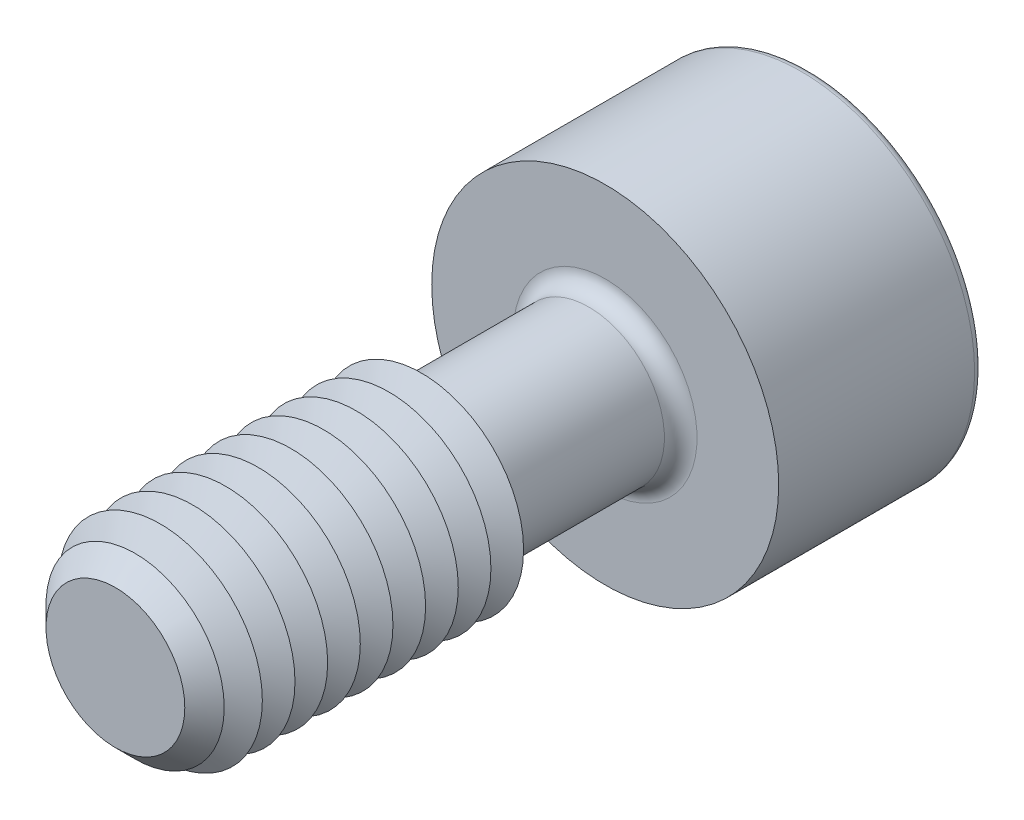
ISO-10303-21;
HEADER;
FILE_DESCRIPTION(('STEP AP214'),'2;1');
FILE_NAME('part.step','',(''),(''),'','','');
FILE_SCHEMA(('AUTOMOTIVE_DESIGN { 1 0 10303 214 1 1 1 1 }'));
ENDSEC;
DATA;
#1=APPLICATION_CONTEXT('core data for automotive mechanical design processes');
#2=APPLICATION_PROTOCOL_DEFINITION('international standard','automotive_design',2000,#1);
#3=PRODUCT_CONTEXT('',#1,'mechanical');
#4=PRODUCT('Part','Part','',(#3));
#5=PRODUCT_RELATED_PRODUCT_CATEGORY('part','',(#4));
#6=PRODUCT_DEFINITION_FORMATION('','',#4);
#7=PRODUCT_DEFINITION_CONTEXT('part definition',#1,'design');
#8=PRODUCT_DEFINITION('design','',#6,#7);
#9=PRODUCT_DEFINITION_SHAPE('','',#8);
#10=(LENGTH_UNIT() NAMED_UNIT(*) SI_UNIT(.MILLI.,.METRE.));
#11=(NAMED_UNIT(*) PLANE_ANGLE_UNIT() SI_UNIT($,.RADIAN.));
#12=(NAMED_UNIT(*) SI_UNIT($,.STERADIAN.) SOLID_ANGLE_UNIT());
#13=UNCERTAINTY_MEASURE_WITH_UNIT(LENGTH_MEASURE(1.E-05),#10,'distance_accuracy_value','');
#14=(GEOMETRIC_REPRESENTATION_CONTEXT(3) GLOBAL_UNCERTAINTY_ASSIGNED_CONTEXT((#13)) GLOBAL_UNIT_ASSIGNED_CONTEXT((#10,
#11,#12)) REPRESENTATION_CONTEXT('',''));
#15=CARTESIAN_POINT('',(0.,0.,0.));
#16=DIRECTION('',(0.,0.,1.));
#17=DIRECTION('',(1.,0.,0.));
#18=AXIS2_PLACEMENT_3D('',#15,#16,#17);
#19=CARTESIAN_POINT('',(-1.15470053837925,-2.,-7.));
#20=DIRECTION('',(0.,0.,1.));
#21=DIRECTION('',(1.,0.,0.));
#22=AXIS2_PLACEMENT_3D('',#19,#20,#21);
#23=PLANE('',#22);
#24=DIRECTION('',(1.,0.,0.));
#25=VECTOR('',#24,1.);
#26=CARTESIAN_POINT('',(-1.15470053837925,-2.,-7.));
#27=LINE('',#26,#25);
#28=CARTESIAN_POINT('',(0.,-2.,-7.));
#29=VERTEX_POINT('',#28);
#30=CARTESIAN_POINT('',(1.15470053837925,-2.,-7.));
#31=VERTEX_POINT('',#30);
#32=EDGE_CURVE('E795',#29,#31,#27,.T.);
#33=ORIENTED_EDGE('',*,*,#32,.F.);
#34=CARTESIAN_POINT('',(0.,0.,-7.));
#35=DIRECTION('',(0.,0.,1.));
#36=DIRECTION('',(0.,-1.,0.));
#37=AXIS2_PLACEMENT_3D('',#34,#35,#36);
#38=CIRCLE('',#37,2.);
#39=CARTESIAN_POINT('',(1.73205080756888,-1.,-7.));
#40=VERTEX_POINT('',#39);
#41=EDGE_CURVE('E53',#29,#40,#38,.T.);
#42=ORIENTED_EDGE('',*,*,#41,.T.);
#43=DIRECTION('',(0.5,0.866025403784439,0.));
#44=VECTOR('',#43,1.);
#45=CARTESIAN_POINT('',(1.15470053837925,-2.,-7.));
#46=LINE('',#45,#44);
#47=EDGE_CURVE('E780',#31,#40,#46,.T.);
#48=ORIENTED_EDGE('',*,*,#47,.F.);
#49=EDGE_LOOP('',(#33,#42,#48));
#50=FACE_BOUND('',#49,.T.);
#51=ADVANCED_FACE('F41',(#50),#23,.F.);
#52=CARTESIAN_POINT('',(2.3094010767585,0.,-7.));
#53=VERTEX_POINT('',#52);
#54=EDGE_CURVE('E791',#40,#53,#46,.T.);
#55=ORIENTED_EDGE('',*,*,#54,.F.);
#56=CARTESIAN_POINT('',(1.73205080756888,1.,-7.));
#57=VERTEX_POINT('',#56);
#58=EDGE_CURVE('E11',#40,#57,#38,.T.);
#59=ORIENTED_EDGE('',*,*,#58,.T.);
#60=DIRECTION('',(-0.499999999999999,0.866025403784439,0.));
#61=VECTOR('',#60,1.);
#62=CARTESIAN_POINT('',(2.3094010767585,0.,-7.));
#63=LINE('',#62,#61);
#64=EDGE_CURVE('E779',#53,#57,#63,.T.);
#65=ORIENTED_EDGE('',*,*,#64,.F.);
#66=EDGE_LOOP('',(#55,#59,#65));
#67=FACE_BOUND('',#66,.T.);
#68=ADVANCED_FACE('F133',(#67),#23,.F.);
#69=CARTESIAN_POINT('',(1.15470053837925,2.,-7.));
#70=VERTEX_POINT('',#69);
#71=EDGE_CURVE('E774',#57,#70,#63,.T.);
#72=ORIENTED_EDGE('',*,*,#71,.F.);
#73=CARTESIAN_POINT('',(0.,2.,-7.));
#74=VERTEX_POINT('',#73);
#75=EDGE_CURVE('E51',#57,#74,#38,.T.);
#76=ORIENTED_EDGE('',*,*,#75,.T.);
#77=DIRECTION('',(-1.,0.,0.));
#78=VECTOR('',#77,1.);
#79=CARTESIAN_POINT('',(1.15470053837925,2.,-7.));
#80=LINE('',#79,#78);
#81=EDGE_CURVE('E177',#70,#74,#80,.T.);
#82=ORIENTED_EDGE('',*,*,#81,.F.);
#83=EDGE_LOOP('',(#72,#76,#82));
#84=FACE_BOUND('',#83,.T.);
#85=ADVANCED_FACE('F139',(#84),#23,.F.);
#86=CARTESIAN_POINT('',(-1.15470053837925,2.,-7.));
#87=VERTEX_POINT('',#86);
#88=EDGE_CURVE('E785',#74,#87,#80,.T.);
#89=ORIENTED_EDGE('',*,*,#88,.F.);
#90=CARTESIAN_POINT('',(-1.73205080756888,1.,-7.));
#91=VERTEX_POINT('',#90);
#92=EDGE_CURVE('E263',#74,#91,#38,.T.);
#93=ORIENTED_EDGE('',*,*,#92,.T.);
#94=DIRECTION('',(-0.5,-0.866025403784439,0.));
#95=VECTOR('',#94,1.);
#96=CARTESIAN_POINT('',(-1.15470053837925,2.,-7.));
#97=LINE('',#96,#95);
#98=EDGE_CURVE('E176',#87,#91,#97,.T.);
#99=ORIENTED_EDGE('',*,*,#98,.F.);
#100=EDGE_LOOP('',(#89,#93,#99));
#101=FACE_BOUND('',#100,.T.);
#102=ADVANCED_FACE('F157',(#101),#23,.F.);
#103=CARTESIAN_POINT('',(-2.3094010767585,0.,-7.));
#104=VERTEX_POINT('',#103);
#105=EDGE_CURVE('E170',#91,#104,#97,.T.);
#106=ORIENTED_EDGE('',*,*,#105,.F.);
#107=CARTESIAN_POINT('',(-1.73205080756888,-0.999999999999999,-7.));
#108=VERTEX_POINT('',#107);
#109=EDGE_CURVE('E172',#91,#108,#38,.T.);
#110=ORIENTED_EDGE('',*,*,#109,.T.);
#111=DIRECTION('',(0.499999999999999,-0.866025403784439,0.));
#112=VECTOR('',#111,1.);
#113=CARTESIAN_POINT('',(-2.3094010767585,0.,-7.));
#114=LINE('',#113,#112);
#115=EDGE_CURVE('E174',#104,#108,#114,.T.);
#116=ORIENTED_EDGE('',*,*,#115,.F.);
#117=EDGE_LOOP('',(#106,#110,#116));
#118=FACE_BOUND('',#117,.T.);
#119=ADVANCED_FACE('F146',(#118),#23,.F.);
#120=CARTESIAN_POINT('',(0.,0.,-11.));
#121=DIRECTION('',(0.,0.,-1.));
#122=DIRECTION('',(-1.,0.,0.));
#123=AXIS2_PLACEMENT_3D('',#120,#121,#122);
#124=PLANE('',#123);
#125=CARTESIAN_POINT('',(0.,0.,-11.));
#126=DIRECTION('',(0.,0.,-1.));
#127=DIRECTION('',(-1.,0.,0.));
#128=AXIS2_PLACEMENT_3D('',#125,#126,#127);
#129=CIRCLE('',#128,4.05);
#130=CARTESIAN_POINT('',(-4.05,0.,-11.));
#131=VERTEX_POINT('',#130);
#132=EDGE_CURVE('E250',#131,#131,#129,.T.);
#133=ORIENTED_EDGE('',*,*,#132,.T.);
#134=EDGE_LOOP('',(#133));
#135=FACE_BOUND('',#134,.T.);
#136=DIRECTION('',(-0.5,-0.866025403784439,0.));
#137=VECTOR('',#136,1.);
#138=CARTESIAN_POINT('',(-1.15470053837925,2.,-11.));
#139=LINE('',#138,#137);
#140=CARTESIAN_POINT('',(-1.15470053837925,2.,-11.));
#141=VERTEX_POINT('',#140);
#142=CARTESIAN_POINT('',(-2.3094010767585,0.,-11.));
#143=VERTEX_POINT('',#142);
#144=EDGE_CURVE('E211',#141,#143,#139,.T.);
#145=ORIENTED_EDGE('',*,*,#144,.T.);
#146=DIRECTION('',(0.499999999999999,-0.866025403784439,0.));
#147=VECTOR('',#146,1.);
#148=CARTESIAN_POINT('',(-2.3094010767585,0.,-11.));
#149=LINE('',#148,#147);
#150=CARTESIAN_POINT('',(-1.15470053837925,-2.,-11.));
#151=VERTEX_POINT('',#150);
#152=EDGE_CURVE('E67',#143,#151,#149,.T.);
#153=ORIENTED_EDGE('',*,*,#152,.T.);
#154=DIRECTION('',(1.,0.,0.));
#155=VECTOR('',#154,1.);
#156=CARTESIAN_POINT('',(-1.15470053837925,-2.,-11.));
#157=LINE('',#156,#155);
#158=CARTESIAN_POINT('',(1.15470053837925,-2.,-11.));
#159=VERTEX_POINT('',#158);
#160=EDGE_CURVE('E196',#151,#159,#157,.T.);
#161=ORIENTED_EDGE('',*,*,#160,.T.);
#162=DIRECTION('',(0.5,0.866025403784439,0.));
#163=VECTOR('',#162,1.);
#164=CARTESIAN_POINT('',(1.15470053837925,-2.,-11.));
#165=LINE('',#164,#163);
#166=CARTESIAN_POINT('',(2.3094010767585,0.,-11.));
#167=VERTEX_POINT('',#166);
#168=EDGE_CURVE('E200',#159,#167,#165,.T.);
#169=ORIENTED_EDGE('',*,*,#168,.T.);
#170=DIRECTION('',(-0.499999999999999,0.866025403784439,0.));
#171=VECTOR('',#170,1.);
#172=CARTESIAN_POINT('',(2.3094010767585,0.,-11.));
#173=LINE('',#172,#171);
#174=CARTESIAN_POINT('',(1.15470053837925,2.,-11.));
#175=VERTEX_POINT('',#174);
#176=EDGE_CURVE('E204',#167,#175,#173,.T.);
#177=ORIENTED_EDGE('',*,*,#176,.T.);
#178=DIRECTION('',(-1.,0.,0.));
#179=VECTOR('',#178,1.);
#180=CARTESIAN_POINT('',(1.15470053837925,2.,-11.));
#181=LINE('',#180,#179);
#182=EDGE_CURVE('E208',#175,#141,#181,.T.);
#183=ORIENTED_EDGE('',*,*,#182,.T.);
#184=EDGE_LOOP('',(#145,#153,#161,#169,#177,#183));
#185=FACE_BOUND('',#184,.T.);
#186=ADVANCED_FACE('F156',(#135,#185),#124,.T.);
#187=CARTESIAN_POINT('',(0.,0.,6.));
#188=DIRECTION('',(0.,0.,-1.));
#189=DIRECTION('',(-1.,0.,0.));
#190=AXIS2_PLACEMENT_3D('',#187,#188,#189);
#191=CYLINDRICAL_SURFACE('',#190,1.85);
#192=CARTESIAN_POINT('',(0.,0.,-5.6));
#193=DIRECTION('',(0.,0.,-1.));
#194=DIRECTION('',(-1.,0.,0.));
#195=AXIS2_PLACEMENT_3D('',#192,#193,#194);
#196=CIRCLE('',#195,1.85);
#197=CARTESIAN_POINT('',(-1.85,0.,-5.6));
#198=VERTEX_POINT('',#197);
#199=EDGE_CURVE('E246',#198,#198,#196,.F.);
#200=ORIENTED_EDGE('',*,*,#199,.T.);
#201=EDGE_LOOP('',(#200));
#202=FACE_BOUND('',#201,.T.);
#203=CARTESIAN_POINT('',(0.,0.,-1.87527767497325));
#204=DIRECTION('',(0.,0.,-1.));
#205=DIRECTION('',(0.,1.,0.));
#206=AXIS2_PLACEMENT_3D('',#203,#204,#205);
#207=CIRCLE('',#206,1.85);
#208=CARTESIAN_POINT('',(0.,1.85,-1.87527767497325));
#209=VERTEX_POINT('',#208);
#210=EDGE_CURVE('E234',#209,#209,#207,.T.);
#211=ORIENTED_EDGE('',*,*,#210,.T.);
#212=EDGE_LOOP('',(#211));
#213=FACE_BOUND('',#212,.T.);
#214=ADVANCED_FACE('F163',(#202,#213),#191,.T.);
#215=CARTESIAN_POINT('',(0.,0.,-1.87527767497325));
#216=DIRECTION('',(0.,0.,1.));
#217=DIRECTION('',(0.,-1.,0.));
#218=AXIS2_PLACEMENT_3D('',#215,#216,#217);
#219=CONICAL_SURFACE('',#218,1.85,1.0471975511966);
#220=CARTESIAN_POINT('',(0.,0.,-1.5));
#221=DIRECTION('',(0.,0.,-1.));
#222=DIRECTION('',(-1.,0.,0.));
#223=AXIS2_PLACEMENT_3D('',#220,#221,#222);
#224=CIRCLE('',#223,2.5);
#225=CARTESIAN_POINT('',(-2.5,0.,-1.5));
#226=VERTEX_POINT('',#225);
#227=EDGE_CURVE('E267',#226,#226,#224,.T.);
#228=ORIENTED_EDGE('',*,*,#227,.T.);
#229=EDGE_LOOP('',(#228));
#230=FACE_BOUND('',#229,.T.);
#231=ORIENTED_EDGE('',*,*,#210,.F.);
#232=EDGE_LOOP('',(#231));
#233=FACE_BOUND('',#232,.T.);
#234=ADVANCED_FACE('F535',(#230,#233),#219,.T.);
#235=CARTESIAN_POINT('',(0.,0.,-6.));
#236=DIRECTION('',(0.,0.,-1.));
#237=DIRECTION('',(-1.,0.,0.));
#238=AXIS2_PLACEMENT_3D('',#235,#236,#237);
#239=PLANE('',#238);
#240=CARTESIAN_POINT('',(0.,0.,-6.));
#241=DIRECTION('',(0.,0.,-1.));
#242=DIRECTION('',(-1.,0.,0.));
#243=AXIS2_PLACEMENT_3D('',#240,#241,#242);
#244=CIRCLE('',#243,2.25);
#245=CARTESIAN_POINT('',(-2.25,0.,-6.));
#246=VERTEX_POINT('',#245);
#247=EDGE_CURVE('E242',#246,#246,#244,.T.);
#248=ORIENTED_EDGE('',*,*,#247,.T.);
#249=EDGE_LOOP('',(#248));
#250=FACE_BOUND('',#249,.T.);
#251=CARTESIAN_POINT('',(0.,0.,-6.));
#252=DIRECTION('',(0.,0.,-1.));
#253=DIRECTION('',(-1.,0.,0.));
#254=AXIS2_PLACEMENT_3D('',#251,#252,#253);
#255=CIRCLE('',#254,4.25);
#256=CARTESIAN_POINT('',(-4.25,0.,-6.));
#257=VERTEX_POINT('',#256);
#258=EDGE_CURVE('E230',#257,#257,#255,.T.);
#259=ORIENTED_EDGE('',*,*,#258,.F.);
#260=EDGE_LOOP('',(#259));
#261=FACE_BOUND('',#260,.T.);
#262=ADVANCED_FACE('F528',(#250,#261),#239,.F.);
#263=CARTESIAN_POINT('',(0.,0.,-11.));
#264=DIRECTION('',(0.,0.,1.));
#265=DIRECTION('',(1.,0.,0.));
#266=AXIS2_PLACEMENT_3D('',#263,#264,#265);
#267=CYLINDRICAL_SURFACE('',#266,4.25);
#268=CARTESIAN_POINT('',(0.,0.,-10.8));
#269=DIRECTION('',(0.,0.,-1.));
#270=DIRECTION('',(-1.,0.,0.));
#271=AXIS2_PLACEMENT_3D('',#268,#269,#270);
#272=CIRCLE('',#271,4.25);
#273=CARTESIAN_POINT('',(-4.25,0.,-10.8));
#274=VERTEX_POINT('',#273);
#275=EDGE_CURVE('E253',#274,#274,#272,.F.);
#276=ORIENTED_EDGE('',*,*,#275,.T.);
#277=EDGE_LOOP('',(#276));
#278=FACE_BOUND('',#277,.T.);
#279=ORIENTED_EDGE('',*,*,#258,.T.);
#280=EDGE_LOOP('',(#279));
#281=FACE_BOUND('',#280,.T.);
#282=ADVANCED_FACE('F534',(#278,#281),#267,.T.);
#283=CARTESIAN_POINT('',(-2.3094010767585,0.,-7.));
#284=DIRECTION('',(0.866025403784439,0.499999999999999,0.));
#285=DIRECTION('',(-0.499999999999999,0.866025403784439,0.));
#286=AXIS2_PLACEMENT_3D('',#283,#284,#285);
#287=PLANE('',#286);
#288=ORIENTED_EDGE('',*,*,#152,.F.);
#289=DIRECTION('',(0.,0.,-1.));
#290=VECTOR('',#289,1.);
#291=CARTESIAN_POINT('',(-2.3094010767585,0.,-7.));
#292=LINE('',#291,#290);
#293=EDGE_CURVE('E186',#104,#143,#292,.T.);
#294=ORIENTED_EDGE('',*,*,#293,.F.);
#295=ORIENTED_EDGE('',*,*,#115,.T.);
#296=CARTESIAN_POINT('',(-1.15470053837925,-2.,-7.));
#297=VERTEX_POINT('',#296);
#298=EDGE_CURVE('E214',#108,#297,#114,.T.);
#299=ORIENTED_EDGE('',*,*,#298,.T.);
#300=DIRECTION('',(0.,0.,-1.));
#301=VECTOR('',#300,1.);
#302=CARTESIAN_POINT('',(-1.15470053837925,-2.,-7.));
#303=LINE('',#302,#301);
#304=EDGE_CURVE('E227',#297,#151,#303,.T.);
#305=ORIENTED_EDGE('',*,*,#304,.T.);
#306=EDGE_LOOP('',(#288,#294,#295,#299,#305));
#307=FACE_BOUND('',#306,.T.);
#308=ADVANCED_FACE('F546',(#307),#287,.T.);
#309=CARTESIAN_POINT('',(-1.15470053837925,-2.,-7.));
#310=DIRECTION('',(0.,1.,0.));
#311=DIRECTION('',(0.,0.,1.));
#312=AXIS2_PLACEMENT_3D('',#309,#310,#311);
#313=PLANE('',#312);
#314=ORIENTED_EDGE('',*,*,#160,.F.);
#315=ORIENTED_EDGE('',*,*,#304,.F.);
#316=EDGE_CURVE('E792',#297,#29,#27,.T.);
#317=ORIENTED_EDGE('',*,*,#316,.T.);
#318=ORIENTED_EDGE('',*,*,#32,.T.);
#319=DIRECTION('',(0.,0.,-1.));
#320=VECTOR('',#319,1.);
#321=CARTESIAN_POINT('',(1.15470053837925,-2.,-7.));
#322=LINE('',#321,#320);
#323=EDGE_CURVE('E224',#31,#159,#322,.T.);
#324=ORIENTED_EDGE('',*,*,#323,.T.);
#325=EDGE_LOOP('',(#314,#315,#317,#318,#324));
#326=FACE_BOUND('',#325,.T.);
#327=ADVANCED_FACE('F562',(#326),#313,.T.);
#328=CARTESIAN_POINT('',(1.15470053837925,-2.,-7.));
#329=DIRECTION('',(-0.866025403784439,0.5,0.));
#330=DIRECTION('',(-0.5,-0.866025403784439,0.));
#331=AXIS2_PLACEMENT_3D('',#328,#329,#330);
#332=PLANE('',#331);
#333=ORIENTED_EDGE('',*,*,#168,.F.);
#334=ORIENTED_EDGE('',*,*,#323,.F.);
#335=ORIENTED_EDGE('',*,*,#47,.T.);
#336=ORIENTED_EDGE('',*,*,#54,.T.);
#337=DIRECTION('',(0.,0.,-1.));
#338=VECTOR('',#337,1.);
#339=CARTESIAN_POINT('',(2.3094010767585,0.,-7.));
#340=LINE('',#339,#338);
#341=EDGE_CURVE('E221',#53,#167,#340,.T.);
#342=ORIENTED_EDGE('',*,*,#341,.T.);
#343=EDGE_LOOP('',(#333,#334,#335,#336,#342));
#344=FACE_BOUND('',#343,.T.);
#345=ADVANCED_FACE('F572',(#344),#332,.T.);
#346=CARTESIAN_POINT('',(2.3094010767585,0.,-7.));
#347=DIRECTION('',(-0.866025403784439,-0.499999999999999,0.));
#348=DIRECTION('',(0.499999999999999,-0.866025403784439,0.));
#349=AXIS2_PLACEMENT_3D('',#346,#347,#348);
#350=PLANE('',#349);
#351=ORIENTED_EDGE('',*,*,#176,.F.);
#352=ORIENTED_EDGE('',*,*,#341,.F.);
#353=ORIENTED_EDGE('',*,*,#64,.T.);
#354=ORIENTED_EDGE('',*,*,#71,.T.);
#355=DIRECTION('',(0.,0.,-1.));
#356=VECTOR('',#355,1.);
#357=CARTESIAN_POINT('',(1.15470053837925,2.,-7.));
#358=LINE('',#357,#356);
#359=EDGE_CURVE('E218',#70,#175,#358,.T.);
#360=ORIENTED_EDGE('',*,*,#359,.T.);
#361=EDGE_LOOP('',(#351,#352,#353,#354,#360));
#362=FACE_BOUND('',#361,.T.);
#363=ADVANCED_FACE('F582',(#362),#350,.T.);
#364=CARTESIAN_POINT('',(1.15470053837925,2.,-7.));
#365=DIRECTION('',(0.,-1.,0.));
#366=DIRECTION('',(0.,0.,-1.));
#367=AXIS2_PLACEMENT_3D('',#364,#365,#366);
#368=PLANE('',#367);
#369=ORIENTED_EDGE('',*,*,#182,.F.);
#370=ORIENTED_EDGE('',*,*,#359,.F.);
#371=ORIENTED_EDGE('',*,*,#81,.T.);
#372=ORIENTED_EDGE('',*,*,#88,.T.);
#373=DIRECTION('',(0.,0.,-1.));
#374=VECTOR('',#373,1.);
#375=CARTESIAN_POINT('',(-1.15470053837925,2.,-7.));
#376=LINE('',#375,#374);
#377=EDGE_CURVE('E182',#87,#141,#376,.T.);
#378=ORIENTED_EDGE('',*,*,#377,.T.);
#379=EDGE_LOOP('',(#369,#370,#371,#372,#378));
#380=FACE_BOUND('',#379,.T.);
#381=ADVANCED_FACE('F152',(#380),#368,.T.);
#382=CARTESIAN_POINT('',(-1.15470053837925,2.,-7.));
#383=DIRECTION('',(0.866025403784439,-0.5,0.));
#384=DIRECTION('',(0.5,0.866025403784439,0.));
#385=AXIS2_PLACEMENT_3D('',#382,#383,#384);
#386=PLANE('',#385);
#387=ORIENTED_EDGE('',*,*,#144,.F.);
#388=ORIENTED_EDGE('',*,*,#377,.F.);
#389=ORIENTED_EDGE('',*,*,#98,.T.);
#390=ORIENTED_EDGE('',*,*,#105,.T.);
#391=ORIENTED_EDGE('',*,*,#293,.T.);
#392=EDGE_LOOP('',(#387,#388,#389,#390,#391));
#393=FACE_BOUND('',#392,.T.);
#394=ADVANCED_FACE('F144',(#393),#386,.T.);
#395=ORIENTED_EDGE('',*,*,#298,.F.);
#396=EDGE_CURVE('E256',#108,#29,#38,.T.);
#397=ORIENTED_EDGE('',*,*,#396,.T.);
#398=ORIENTED_EDGE('',*,*,#316,.F.);
#399=EDGE_LOOP('',(#395,#397,#398));
#400=FACE_BOUND('',#399,.T.);
#401=ADVANCED_FACE('F135',(#400),#23,.F.);
#402=CARTESIAN_POINT('',(0.,0.,-5.6));
#403=DIRECTION('',(0.,0.,-1.));
#404=DIRECTION('',(-1.,0.,0.));
#405=AXIS2_PLACEMENT_3D('',#402,#403,#404);
#406=TOROIDAL_SURFACE('',#405,2.25,0.4);
#407=ORIENTED_EDGE('',*,*,#199,.F.);
#408=EDGE_LOOP('',(#407));
#409=FACE_BOUND('',#408,.T.);
#410=ORIENTED_EDGE('',*,*,#247,.F.);
#411=EDGE_LOOP('',(#410));
#412=FACE_BOUND('',#411,.T.);
#413=ADVANCED_FACE('F129',(#409,#412),#406,.F.);
#414=CARTESIAN_POINT('',(0.,0.,-10.8));
#415=DIRECTION('',(0.,0.,-1.));
#416=DIRECTION('',(-1.,0.,0.));
#417=AXIS2_PLACEMENT_3D('',#414,#415,#416);
#418=TOROIDAL_SURFACE('',#417,4.05,0.2);
#419=ORIENTED_EDGE('',*,*,#275,.F.);
#420=EDGE_LOOP('',(#419));
#421=FACE_BOUND('',#420,.T.);
#422=ORIENTED_EDGE('',*,*,#132,.F.);
#423=EDGE_LOOP('',(#422));
#424=FACE_BOUND('',#423,.T.);
#425=ADVANCED_FACE('F43',(#421,#424),#418,.T.);
#426=CARTESIAN_POINT('',(0.,0.,-5.84529946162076));
#427=DIRECTION('',(0.,0.,-1.));
#428=DIRECTION('',(0.,1.,0.));
#429=AXIS2_PLACEMENT_3D('',#426,#427,#428);
#430=CONICAL_SURFACE('',#429,0.,1.0471975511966);
#431=ORIENTED_EDGE('',*,*,#41,.F.);
#432=ORIENTED_EDGE('',*,*,#396,.F.);
#433=ORIENTED_EDGE('',*,*,#109,.F.);
#434=ORIENTED_EDGE('',*,*,#92,.F.);
#435=ORIENTED_EDGE('',*,*,#75,.F.);
#436=ORIENTED_EDGE('',*,*,#58,.F.);
#437=EDGE_LOOP('',(#431,#432,#433,#434,#435,#436));
#438=FACE_BOUND('',#437,.T.);
#439=CARTESIAN_POINT('',(0.,0.,-5.84529946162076));
#440=VERTEX_POINT('',#439);
#441=VERTEX_LOOP('',#440);
#442=FACE_BOUND('',#441,.T.);
#443=ADVANCED_FACE('F118',(#438,#442),#430,.F.);
#444=CARTESIAN_POINT('',(0.,0.,-1.1));
#445=DIRECTION('',(0.,0.,-1.));
#446=DIRECTION('',(-1.,0.,0.));
#447=AXIS2_PLACEMENT_3D('',#444,#445,#446);
#448=CONICAL_SURFACE('',#447,1.80717967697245,1.0471975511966);
#449=ORIENTED_EDGE('',*,*,#227,.F.);
#450=EDGE_LOOP('',(#449));
#451=FACE_BOUND('',#450,.T.);
#452=CARTESIAN_POINT('',(0.,0.,-1.1));
#453=DIRECTION('',(0.,0.,-1.));
#454=DIRECTION('',(-1.,0.,0.));
#455=AXIS2_PLACEMENT_3D('',#452,#453,#454);
#456=CIRCLE('',#455,1.80717967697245);
#457=CARTESIAN_POINT('',(-1.80717967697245,0.,-1.1));
#458=VERTEX_POINT('',#457);
#459=EDGE_CURVE('E273',#458,#458,#456,.T.);
#460=ORIENTED_EDGE('',*,*,#459,.T.);
#461=EDGE_LOOP('',(#460));
#462=FACE_BOUND('',#461,.T.);
#463=ADVANCED_FACE('F120',(#451,#462),#448,.T.);
#464=CARTESIAN_POINT('',(0.,0.,-0.700000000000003));
#465=DIRECTION('',(0.,0.,1.));
#466=DIRECTION('',(1.,0.,0.));
#467=AXIS2_PLACEMENT_3D('',#464,#465,#466);
#468=CONICAL_SURFACE('',#467,2.5,1.0471975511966);
#469=ORIENTED_EDGE('',*,*,#459,.F.);
#470=EDGE_LOOP('',(#469));
#471=FACE_BOUND('',#470,.T.);
#472=CARTESIAN_POINT('',(0.,0.,-0.700000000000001));
#473=DIRECTION('',(0.,0.,-1.));
#474=DIRECTION('',(-1.,0.,0.));
#475=AXIS2_PLACEMENT_3D('',#472,#473,#474);
#476=CIRCLE('',#475,2.5);
#477=CARTESIAN_POINT('',(-2.5,0.,-0.700000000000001));
#478=VERTEX_POINT('',#477);
#479=EDGE_CURVE('E280',#478,#478,#476,.T.);
#480=ORIENTED_EDGE('',*,*,#479,.T.);
#481=EDGE_LOOP('',(#480));
#482=FACE_BOUND('',#481,.T.);
#483=ADVANCED_FACE('F126',(#471,#482),#468,.T.);
#484=CARTESIAN_POINT('',(0.,0.,-0.3));
#485=DIRECTION('',(0.,0.,-1.));
#486=DIRECTION('',(-1.,0.,0.));
#487=AXIS2_PLACEMENT_3D('',#484,#485,#486);
#488=CONICAL_SURFACE('',#487,1.80717967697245,1.0471975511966);
#489=ORIENTED_EDGE('',*,*,#479,.F.);
#490=EDGE_LOOP('',(#489));
#491=FACE_BOUND('',#490,.T.);
#492=CARTESIAN_POINT('',(0.,0.,-0.3));
#493=DIRECTION('',(0.,0.,-1.));
#494=DIRECTION('',(-1.,0.,0.));
#495=AXIS2_PLACEMENT_3D('',#492,#493,#494);
#496=CIRCLE('',#495,1.80717967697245);
#497=CARTESIAN_POINT('',(-1.80717967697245,0.,-0.3));
#498=VERTEX_POINT('',#497);
#499=EDGE_CURVE('E286',#498,#498,#496,.T.);
#500=ORIENTED_EDGE('',*,*,#499,.T.);
#501=EDGE_LOOP('',(#500));
#502=FACE_BOUND('',#501,.T.);
#503=ADVANCED_FACE('F412',(#491,#502),#488,.T.);
#504=CARTESIAN_POINT('',(0.,0.,0.0999999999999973));
#505=DIRECTION('',(0.,0.,1.));
#506=DIRECTION('',(1.,0.,0.));
#507=AXIS2_PLACEMENT_3D('',#504,#505,#506);
#508=CONICAL_SURFACE('',#507,2.5,1.0471975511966);
#509=ORIENTED_EDGE('',*,*,#499,.F.);
#510=EDGE_LOOP('',(#509));
#511=FACE_BOUND('',#510,.T.);
#512=CARTESIAN_POINT('',(0.,0.,0.0999999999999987));
#513=DIRECTION('',(0.,0.,-1.));
#514=DIRECTION('',(-1.,0.,0.));
#515=AXIS2_PLACEMENT_3D('',#512,#513,#514);
#516=CIRCLE('',#515,2.5);
#517=CARTESIAN_POINT('',(-2.5,0.,0.0999999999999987));
#518=VERTEX_POINT('',#517);
#519=EDGE_CURVE('E289',#518,#518,#516,.T.);
#520=ORIENTED_EDGE('',*,*,#519,.T.);
#521=EDGE_LOOP('',(#520));
#522=FACE_BOUND('',#521,.T.);
#523=ADVANCED_FACE('F408',(#511,#522),#508,.T.);
#524=CARTESIAN_POINT('',(0.,0.,0.5));
#525=DIRECTION('',(0.,0.,-1.));
#526=DIRECTION('',(-1.,0.,0.));
#527=AXIS2_PLACEMENT_3D('',#524,#525,#526);
#528=CONICAL_SURFACE('',#527,1.80717967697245,1.0471975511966);
#529=ORIENTED_EDGE('',*,*,#519,.F.);
#530=EDGE_LOOP('',(#529));
#531=FACE_BOUND('',#530,.T.);
#532=CARTESIAN_POINT('',(0.,0.,0.5));
#533=DIRECTION('',(0.,0.,-1.));
#534=DIRECTION('',(-1.,0.,0.));
#535=AXIS2_PLACEMENT_3D('',#532,#533,#534);
#536=CIRCLE('',#535,1.80717967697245);
#537=CARTESIAN_POINT('',(-1.80717967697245,0.,0.5));
#538=VERTEX_POINT('',#537);
#539=EDGE_CURVE('E293',#538,#538,#536,.T.);
#540=ORIENTED_EDGE('',*,*,#539,.T.);
#541=EDGE_LOOP('',(#540));
#542=FACE_BOUND('',#541,.T.);
#543=ADVANCED_FACE('F404',(#531,#542),#528,.T.);
#544=CARTESIAN_POINT('',(0.,0.,0.899999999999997));
#545=DIRECTION('',(0.,0.,1.));
#546=DIRECTION('',(1.,0.,0.));
#547=AXIS2_PLACEMENT_3D('',#544,#545,#546);
#548=CONICAL_SURFACE('',#547,2.5,1.0471975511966);
#549=ORIENTED_EDGE('',*,*,#539,.F.);
#550=EDGE_LOOP('',(#549));
#551=FACE_BOUND('',#550,.T.);
#552=CARTESIAN_POINT('',(0.,0.,0.899999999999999));
#553=DIRECTION('',(0.,0.,-1.));
#554=DIRECTION('',(-1.,0.,0.));
#555=AXIS2_PLACEMENT_3D('',#552,#553,#554);
#556=CIRCLE('',#555,2.5);
#557=CARTESIAN_POINT('',(-2.5,0.,0.899999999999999));
#558=VERTEX_POINT('',#557);
#559=EDGE_CURVE('E297',#558,#558,#556,.T.);
#560=ORIENTED_EDGE('',*,*,#559,.T.);
#561=EDGE_LOOP('',(#560));
#562=FACE_BOUND('',#561,.T.);
#563=ADVANCED_FACE('F400',(#551,#562),#548,.T.);
#564=CARTESIAN_POINT('',(0.,0.,1.3));
#565=DIRECTION('',(0.,0.,-1.));
#566=DIRECTION('',(-1.,0.,0.));
#567=AXIS2_PLACEMENT_3D('',#564,#565,#566);
#568=CONICAL_SURFACE('',#567,1.80717967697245,1.0471975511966);
#569=ORIENTED_EDGE('',*,*,#559,.F.);
#570=EDGE_LOOP('',(#569));
#571=FACE_BOUND('',#570,.T.);
#572=CARTESIAN_POINT('',(0.,0.,1.3));
#573=DIRECTION('',(0.,0.,-1.));
#574=DIRECTION('',(-1.,0.,0.));
#575=AXIS2_PLACEMENT_3D('',#572,#573,#574);
#576=CIRCLE('',#575,1.80717967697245);
#577=CARTESIAN_POINT('',(-1.80717967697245,0.,1.3));
#578=VERTEX_POINT('',#577);
#579=EDGE_CURVE('E301',#578,#578,#576,.T.);
#580=ORIENTED_EDGE('',*,*,#579,.T.);
#581=EDGE_LOOP('',(#580));
#582=FACE_BOUND('',#581,.T.);
#583=ADVANCED_FACE('F396',(#571,#582),#568,.T.);
#584=CARTESIAN_POINT('',(0.,0.,1.7));
#585=DIRECTION('',(0.,0.,1.));
#586=DIRECTION('',(1.,0.,0.));
#587=AXIS2_PLACEMENT_3D('',#584,#585,#586);
#588=CONICAL_SURFACE('',#587,2.5,1.0471975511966);
#589=ORIENTED_EDGE('',*,*,#579,.F.);
#590=EDGE_LOOP('',(#589));
#591=FACE_BOUND('',#590,.T.);
#592=CARTESIAN_POINT('',(0.,0.,1.7));
#593=DIRECTION('',(0.,0.,-1.));
#594=DIRECTION('',(-1.,0.,0.));
#595=AXIS2_PLACEMENT_3D('',#592,#593,#594);
#596=CIRCLE('',#595,2.5);
#597=CARTESIAN_POINT('',(-2.5,0.,1.7));
#598=VERTEX_POINT('',#597);
#599=EDGE_CURVE('E304',#598,#598,#596,.T.);
#600=ORIENTED_EDGE('',*,*,#599,.T.);
#601=EDGE_LOOP('',(#600));
#602=FACE_BOUND('',#601,.T.);
#603=ADVANCED_FACE('F392',(#591,#602),#588,.T.);
#604=CARTESIAN_POINT('',(0.,0.,2.1));
#605=DIRECTION('',(0.,0.,-1.));
#606=DIRECTION('',(-1.,0.,0.));
#607=AXIS2_PLACEMENT_3D('',#604,#605,#606);
#608=CONICAL_SURFACE('',#607,1.80717967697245,1.0471975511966);
#609=ORIENTED_EDGE('',*,*,#599,.F.);
#610=EDGE_LOOP('',(#609));
#611=FACE_BOUND('',#610,.T.);
#612=CARTESIAN_POINT('',(0.,0.,2.1));
#613=DIRECTION('',(0.,0.,-1.));
#614=DIRECTION('',(-1.,0.,0.));
#615=AXIS2_PLACEMENT_3D('',#612,#613,#614);
#616=CIRCLE('',#615,1.80717967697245);
#617=CARTESIAN_POINT('',(-1.80717967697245,0.,2.1));
#618=VERTEX_POINT('',#617);
#619=EDGE_CURVE('E308',#618,#618,#616,.T.);
#620=ORIENTED_EDGE('',*,*,#619,.T.);
#621=EDGE_LOOP('',(#620));
#622=FACE_BOUND('',#621,.T.);
#623=ADVANCED_FACE('F388',(#611,#622),#608,.T.);
#624=CARTESIAN_POINT('',(0.,0.,2.5));
#625=DIRECTION('',(0.,0.,1.));
#626=DIRECTION('',(1.,0.,0.));
#627=AXIS2_PLACEMENT_3D('',#624,#625,#626);
#628=CONICAL_SURFACE('',#627,2.5,1.0471975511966);
#629=ORIENTED_EDGE('',*,*,#619,.F.);
#630=EDGE_LOOP('',(#629));
#631=FACE_BOUND('',#630,.T.);
#632=CARTESIAN_POINT('',(0.,0.,2.5));
#633=DIRECTION('',(0.,0.,-1.));
#634=DIRECTION('',(-1.,0.,0.));
#635=AXIS2_PLACEMENT_3D('',#632,#633,#634);
#636=CIRCLE('',#635,2.5);
#637=CARTESIAN_POINT('',(-2.5,0.,2.5));
#638=VERTEX_POINT('',#637);
#639=EDGE_CURVE('E312',#638,#638,#636,.T.);
#640=ORIENTED_EDGE('',*,*,#639,.T.);
#641=EDGE_LOOP('',(#640));
#642=FACE_BOUND('',#641,.T.);
#643=ADVANCED_FACE('F384',(#631,#642),#628,.T.);
#644=CARTESIAN_POINT('',(0.,0.,2.9));
#645=DIRECTION('',(0.,0.,-1.));
#646=DIRECTION('',(-1.,0.,0.));
#647=AXIS2_PLACEMENT_3D('',#644,#645,#646);
#648=CONICAL_SURFACE('',#647,1.80717967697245,1.0471975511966);
#649=ORIENTED_EDGE('',*,*,#639,.F.);
#650=EDGE_LOOP('',(#649));
#651=FACE_BOUND('',#650,.T.);
#652=CARTESIAN_POINT('',(0.,0.,2.9));
#653=DIRECTION('',(0.,0.,-1.));
#654=DIRECTION('',(-1.,0.,0.));
#655=AXIS2_PLACEMENT_3D('',#652,#653,#654);
#656=CIRCLE('',#655,1.80717967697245);
#657=CARTESIAN_POINT('',(-1.80717967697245,0.,2.9));
#658=VERTEX_POINT('',#657);
#659=EDGE_CURVE('E316',#658,#658,#656,.T.);
#660=ORIENTED_EDGE('',*,*,#659,.T.);
#661=EDGE_LOOP('',(#660));
#662=FACE_BOUND('',#661,.T.);
#663=ADVANCED_FACE('F380',(#651,#662),#648,.T.);
#664=CARTESIAN_POINT('',(0.,0.,3.3));
#665=DIRECTION('',(0.,0.,1.));
#666=DIRECTION('',(1.,0.,0.));
#667=AXIS2_PLACEMENT_3D('',#664,#665,#666);
#668=CONICAL_SURFACE('',#667,2.5,1.0471975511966);
#669=ORIENTED_EDGE('',*,*,#659,.F.);
#670=EDGE_LOOP('',(#669));
#671=FACE_BOUND('',#670,.T.);
#672=CARTESIAN_POINT('',(0.,0.,3.3));
#673=DIRECTION('',(0.,0.,-1.));
#674=DIRECTION('',(-1.,0.,0.));
#675=AXIS2_PLACEMENT_3D('',#672,#673,#674);
#676=CIRCLE('',#675,2.5);
#677=CARTESIAN_POINT('',(-2.5,0.,3.3));
#678=VERTEX_POINT('',#677);
#679=EDGE_CURVE('E320',#678,#678,#676,.T.);
#680=ORIENTED_EDGE('',*,*,#679,.T.);
#681=EDGE_LOOP('',(#680));
#682=FACE_BOUND('',#681,.T.);
#683=ADVANCED_FACE('F376',(#671,#682),#668,.T.);
#684=CARTESIAN_POINT('',(0.,0.,3.7));
#685=DIRECTION('',(0.,0.,-1.));
#686=DIRECTION('',(-1.,0.,0.));
#687=AXIS2_PLACEMENT_3D('',#684,#685,#686);
#688=CONICAL_SURFACE('',#687,1.80717967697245,1.0471975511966);
#689=ORIENTED_EDGE('',*,*,#679,.F.);
#690=EDGE_LOOP('',(#689));
#691=FACE_BOUND('',#690,.T.);
#692=CARTESIAN_POINT('',(0.,0.,3.7));
#693=DIRECTION('',(0.,0.,-1.));
#694=DIRECTION('',(-1.,0.,0.));
#695=AXIS2_PLACEMENT_3D('',#692,#693,#694);
#696=CIRCLE('',#695,1.80717967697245);
#697=CARTESIAN_POINT('',(-1.80717967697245,0.,3.7));
#698=VERTEX_POINT('',#697);
#699=EDGE_CURVE('E323',#698,#698,#696,.T.);
#700=ORIENTED_EDGE('',*,*,#699,.T.);
#701=EDGE_LOOP('',(#700));
#702=FACE_BOUND('',#701,.T.);
#703=ADVANCED_FACE('F372',(#691,#702),#688,.T.);
#704=CARTESIAN_POINT('',(0.,0.,4.1));
#705=DIRECTION('',(0.,0.,1.));
#706=DIRECTION('',(1.,0.,0.));
#707=AXIS2_PLACEMENT_3D('',#704,#705,#706);
#708=CONICAL_SURFACE('',#707,2.5,1.0471975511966);
#709=ORIENTED_EDGE('',*,*,#699,.F.);
#710=EDGE_LOOP('',(#709));
#711=FACE_BOUND('',#710,.T.);
#712=CARTESIAN_POINT('',(0.,0.,4.1));
#713=DIRECTION('',(0.,0.,-1.));
#714=DIRECTION('',(-1.,0.,0.));
#715=AXIS2_PLACEMENT_3D('',#712,#713,#714);
#716=CIRCLE('',#715,2.5);
#717=CARTESIAN_POINT('',(-2.5,0.,4.1));
#718=VERTEX_POINT('',#717);
#719=EDGE_CURVE('E327',#718,#718,#716,.T.);
#720=ORIENTED_EDGE('',*,*,#719,.T.);
#721=EDGE_LOOP('',(#720));
#722=FACE_BOUND('',#721,.T.);
#723=ADVANCED_FACE('F368',(#711,#722),#708,.T.);
#724=CARTESIAN_POINT('',(0.,0.,4.5));
#725=DIRECTION('',(0.,0.,-1.));
#726=DIRECTION('',(-1.,0.,0.));
#727=AXIS2_PLACEMENT_3D('',#724,#725,#726);
#728=CONICAL_SURFACE('',#727,1.80717967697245,1.0471975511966);
#729=ORIENTED_EDGE('',*,*,#719,.F.);
#730=EDGE_LOOP('',(#729));
#731=FACE_BOUND('',#730,.T.);
#732=CARTESIAN_POINT('',(0.,0.,4.5));
#733=DIRECTION('',(0.,0.,-1.));
#734=DIRECTION('',(-1.,0.,0.));
#735=AXIS2_PLACEMENT_3D('',#732,#733,#734);
#736=CIRCLE('',#735,1.80717967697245);
#737=CARTESIAN_POINT('',(-1.80717967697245,0.,4.5));
#738=VERTEX_POINT('',#737);
#739=EDGE_CURVE('E330',#738,#738,#736,.T.);
#740=ORIENTED_EDGE('',*,*,#739,.T.);
#741=EDGE_LOOP('',(#740));
#742=FACE_BOUND('',#741,.T.);
#743=ADVANCED_FACE('F364',(#731,#742),#728,.T.);
#744=CARTESIAN_POINT('',(0.,0.,4.9));
#745=DIRECTION('',(0.,0.,1.));
#746=DIRECTION('',(1.,0.,0.));
#747=AXIS2_PLACEMENT_3D('',#744,#745,#746);
#748=CONICAL_SURFACE('',#747,2.5,1.0471975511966);
#749=ORIENTED_EDGE('',*,*,#739,.F.);
#750=EDGE_LOOP('',(#749));
#751=FACE_BOUND('',#750,.T.);
#752=CARTESIAN_POINT('',(0.,0.,4.9));
#753=DIRECTION('',(0.,0.,-1.));
#754=DIRECTION('',(-1.,0.,0.));
#755=AXIS2_PLACEMENT_3D('',#752,#753,#754);
#756=CIRCLE('',#755,2.5);
#757=CARTESIAN_POINT('',(-2.5,0.,4.9));
#758=VERTEX_POINT('',#757);
#759=EDGE_CURVE('E334',#758,#758,#756,.T.);
#760=ORIENTED_EDGE('',*,*,#759,.T.);
#761=EDGE_LOOP('',(#760));
#762=FACE_BOUND('',#761,.T.);
#763=ADVANCED_FACE('F357',(#751,#762),#748,.T.);
#764=CARTESIAN_POINT('',(0.,0.,5.3));
#765=DIRECTION('',(0.,0.,-1.));
#766=DIRECTION('',(-1.,0.,0.));
#767=AXIS2_PLACEMENT_3D('',#764,#765,#766);
#768=CONICAL_SURFACE('',#767,1.80717967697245,1.0471975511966);
#769=ORIENTED_EDGE('',*,*,#759,.F.);
#770=EDGE_LOOP('',(#769));
#771=FACE_BOUND('',#770,.T.);
#772=CARTESIAN_POINT('',(0.,0.,5.3));
#773=DIRECTION('',(0.,0.,-1.));
#774=DIRECTION('',(-1.,0.,0.));
#775=AXIS2_PLACEMENT_3D('',#772,#773,#774);
#776=CIRCLE('',#775,1.80717967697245);
#777=CARTESIAN_POINT('',(-1.80717967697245,0.,5.3));
#778=VERTEX_POINT('',#777);
#779=EDGE_CURVE('E338',#778,#778,#776,.T.);
#780=ORIENTED_EDGE('',*,*,#779,.T.);
#781=EDGE_LOOP('',(#780));
#782=FACE_BOUND('',#781,.T.);
#783=ADVANCED_FACE('F343',(#771,#782),#768,.T.);
#784=CARTESIAN_POINT('',(0.,0.,5.7));
#785=DIRECTION('',(0.,0.,1.));
#786=DIRECTION('',(1.,0.,0.));
#787=AXIS2_PLACEMENT_3D('',#784,#785,#786);
#788=CONICAL_SURFACE('',#787,2.5,1.0471975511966);
#789=CARTESIAN_POINT('',(0.,0.,5.51698729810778));
#790=DIRECTION('',(0.,0.,1.));
#791=DIRECTION('',(1.,0.,0.));
#792=AXIS2_PLACEMENT_3D('',#789,#790,#791);
#793=CIRCLE('',#792,2.18301270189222);
#794=CARTESIAN_POINT('',(2.18301270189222,0.,5.51698729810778));
#795=VERTEX_POINT('',#794);
#796=EDGE_CURVE('E45',#795,#795,#793,.F.);
#797=ORIENTED_EDGE('',*,*,#796,.T.);
#798=EDGE_LOOP('',(#797));
#799=FACE_BOUND('',#798,.T.);
#800=ORIENTED_EDGE('',*,*,#779,.F.);
#801=EDGE_LOOP('',(#800));
#802=FACE_BOUND('',#801,.T.);
#803=ADVANCED_FACE('F345',(#799,#802),#788,.T.);
#804=CARTESIAN_POINT('',(0.,0.,6.));
#805=DIRECTION('',(0.,0.,1.));
#806=DIRECTION('',(1.,0.,0.));
#807=AXIS2_PLACEMENT_3D('',#804,#805,#806);
#808=PLANE('',#807);
#809=CARTESIAN_POINT('',(0.,0.,6.));
#810=DIRECTION('',(0.,0.,1.));
#811=DIRECTION('',(1.,0.,0.));
#812=AXIS2_PLACEMENT_3D('',#809,#810,#811);
#813=CIRCLE('',#812,1.69999999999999);
#814=CARTESIAN_POINT('',(1.69999999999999,0.,6.));
#815=VERTEX_POINT('',#814);
#816=EDGE_CURVE('E238',#815,#815,#813,.T.);
#817=ORIENTED_EDGE('',*,*,#816,.T.);
#818=EDGE_LOOP('',(#817));
#819=FACE_BOUND('',#818,.T.);
#820=ADVANCED_FACE('F347',(#819),#808,.T.);
#821=CARTESIAN_POINT('',(0.,0.,5.2));
#822=DIRECTION('',(0.,0.,-1.));
#823=DIRECTION('',(0.,1.,0.));
#824=AXIS2_PLACEMENT_3D('',#821,#822,#823);
#825=CONICAL_SURFACE('',#824,2.5,0.78539816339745);
#826=ORIENTED_EDGE('',*,*,#796,.F.);
#827=EDGE_LOOP('',(#826));
#828=FACE_BOUND('',#827,.T.);
#829=ORIENTED_EDGE('',*,*,#816,.F.);
#830=EDGE_LOOP('',(#829));
#831=FACE_BOUND('',#830,.T.);
#832=ADVANCED_FACE('F354',(#828,#831),#825,.T.);
#833=CLOSED_SHELL('',(#51,#68,#85,#102,#119,#186,#214,#234,#262,#282,#308,#327,#345,#363,#381,
#394,#401,#413,#425,#443,#463,#483,#503,#523,#543,#563,#583,#603,#623,#643,#663,#683,#703,#723,
#743,#763,#783,#803,#820,#832));
#834=MANIFOLD_SOLID_BREP('B2',#833);
#835=ADVANCED_BREP_SHAPE_REPRESENTATION('',(#18,#834),#14);
#836=SHAPE_DEFINITION_REPRESENTATION(#9,#835);
ENDSEC;
END-ISO-10303-21;
